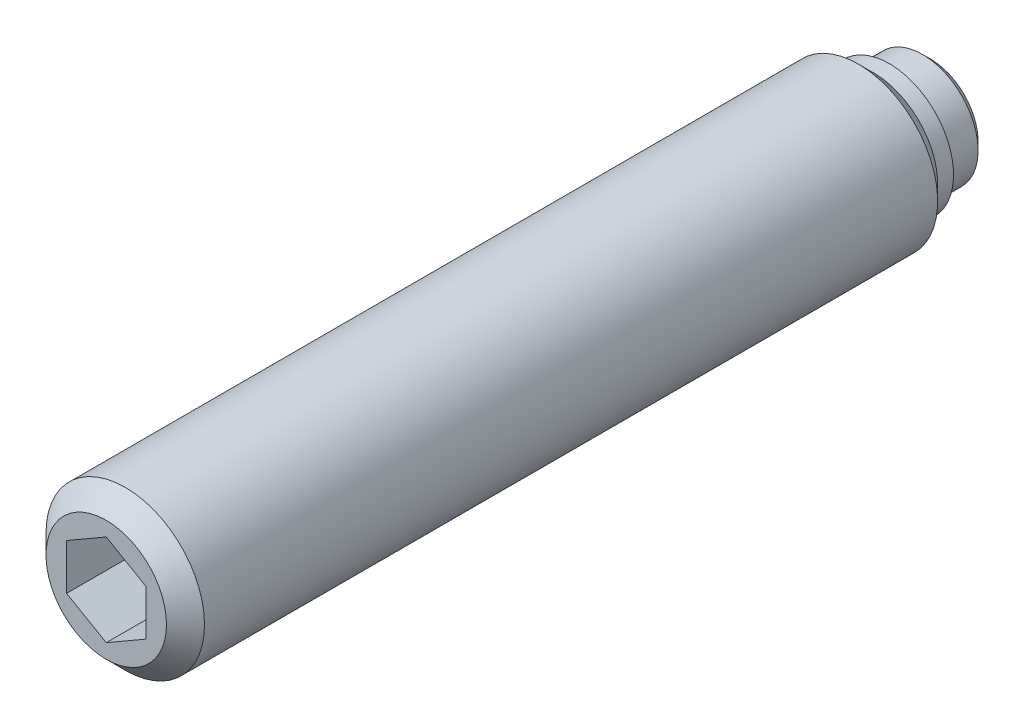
ISO-10303-21;
HEADER;
FILE_DESCRIPTION(('STEP AP214'),'2;1');
FILE_NAME('part.step','',(''),(''),'','','');
FILE_SCHEMA(('AUTOMOTIVE_DESIGN { 1 0 10303 214 1 1 1 1 }'));
ENDSEC;
DATA;
#1=APPLICATION_CONTEXT('core data for automotive mechanical design processes');
#2=APPLICATION_PROTOCOL_DEFINITION('international standard','automotive_design',2000,#1);
#3=PRODUCT_CONTEXT('',#1,'mechanical');
#4=PRODUCT('Part','Part','',(#3));
#5=PRODUCT_RELATED_PRODUCT_CATEGORY('part','',(#4));
#6=PRODUCT_DEFINITION_FORMATION('','',#4);
#7=PRODUCT_DEFINITION_CONTEXT('part definition',#1,'design');
#8=PRODUCT_DEFINITION('design','',#6,#7);
#9=PRODUCT_DEFINITION_SHAPE('','',#8);
#10=(LENGTH_UNIT() NAMED_UNIT(*) SI_UNIT(.MILLI.,.METRE.));
#11=(NAMED_UNIT(*) PLANE_ANGLE_UNIT() SI_UNIT($,.RADIAN.));
#12=(NAMED_UNIT(*) SI_UNIT($,.STERADIAN.) SOLID_ANGLE_UNIT());
#13=UNCERTAINTY_MEASURE_WITH_UNIT(LENGTH_MEASURE(1.E-05),#10,'distance_accuracy_value','');
#14=(GEOMETRIC_REPRESENTATION_CONTEXT(3) GLOBAL_UNCERTAINTY_ASSIGNED_CONTEXT((#13)) GLOBAL_UNIT_ASSIGNED_CONTEXT((#10,
#11,#12)) REPRESENTATION_CONTEXT('',''));
#15=CARTESIAN_POINT('',(0.,0.,0.));
#16=DIRECTION('',(0.,0.,1.));
#17=DIRECTION('',(1.,0.,0.));
#18=AXIS2_PLACEMENT_3D('',#15,#16,#17);
#19=CARTESIAN_POINT('',(0.,0.,2.6));
#20=DIRECTION('',(0.,0.,-1.));
#21=DIRECTION('',(-1.,0.,0.));
#22=AXIS2_PLACEMENT_3D('',#19,#20,#21);
#23=CYLINDRICAL_SURFACE('',#22,5.);
#24=CARTESIAN_POINT('',(0.,0.,4.55));
#25=DIRECTION('',(0.,0.,-1.));
#26=DIRECTION('',(-1.,0.,0.));
#27=AXIS2_PLACEMENT_3D('',#24,#25,#26);
#28=CIRCLE('',#27,5.);
#29=CARTESIAN_POINT('',(-5.,0.,4.55));
#30=VERTEX_POINT('',#29);
#31=EDGE_CURVE('E9',#30,#30,#28,.T.);
#32=ORIENTED_EDGE('',*,*,#31,.F.);
#33=EDGE_LOOP('',(#32));
#34=FACE_BOUND('',#33,.T.);
#35=CARTESIAN_POINT('',(0.,0.,50.8));
#36=DIRECTION('',(0.,0.,1.));
#37=DIRECTION('',(1.,0.,0.));
#38=AXIS2_PLACEMENT_3D('',#35,#36,#37);
#39=CIRCLE('',#38,5.);
#40=CARTESIAN_POINT('',(5.,0.,50.8));
#41=VERTEX_POINT('',#40);
#42=EDGE_CURVE('E123',#41,#41,#39,.T.);
#43=ORIENTED_EDGE('',*,*,#42,.F.);
#44=EDGE_LOOP('',(#43));
#45=FACE_BOUND('',#44,.T.);
#46=ADVANCED_FACE('F14',(#34,#45),#23,.T.);
#47=CARTESIAN_POINT('',(0.,0.,4.55));
#48=DIRECTION('',(0.,0.,1.));
#49=DIRECTION('',(1.,0.,0.));
#50=AXIS2_PLACEMENT_3D('',#47,#48,#49);
#51=CONICAL_SURFACE('',#50,5.,0.785398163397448);
#52=ORIENTED_EDGE('',*,*,#31,.T.);
#53=EDGE_LOOP('',(#52));
#54=FACE_BOUND('',#53,.T.);
#55=CARTESIAN_POINT('',(0.,0.,3.6));
#56=DIRECTION('',(0.,0.,-1.));
#57=DIRECTION('',(-1.,0.,0.));
#58=AXIS2_PLACEMENT_3D('',#55,#56,#57);
#59=CIRCLE('',#58,4.05);
#60=CARTESIAN_POINT('',(-4.05,0.,3.6));
#61=VERTEX_POINT('',#60);
#62=EDGE_CURVE('E21',#61,#61,#59,.T.);
#63=ORIENTED_EDGE('',*,*,#62,.F.);
#64=EDGE_LOOP('',(#63));
#65=FACE_BOUND('',#64,.T.);
#66=ADVANCED_FACE('F143',(#54,#65),#51,.T.);
#67=CARTESIAN_POINT('',(0.,0.,2.6));
#68=DIRECTION('',(0.,0.,-1.));
#69=DIRECTION('',(-1.,0.,0.));
#70=AXIS2_PLACEMENT_3D('',#67,#68,#69);
#71=CYLINDRICAL_SURFACE('',#70,4.05);
#72=ORIENTED_EDGE('',*,*,#62,.T.);
#73=EDGE_LOOP('',(#72));
#74=FACE_BOUND('',#73,.T.);
#75=CARTESIAN_POINT('',(0.,0.,2.6));
#76=DIRECTION('',(0.,0.,-1.));
#77=DIRECTION('',(-1.,0.,0.));
#78=AXIS2_PLACEMENT_3D('',#75,#76,#77);
#79=CIRCLE('',#78,4.05);
#80=CARTESIAN_POINT('',(-4.05,0.,2.6));
#81=VERTEX_POINT('',#80);
#82=EDGE_CURVE('E135',#81,#81,#79,.T.);
#83=ORIENTED_EDGE('',*,*,#82,.F.);
#84=EDGE_LOOP('',(#83));
#85=FACE_BOUND('',#84,.T.);
#86=ADVANCED_FACE('F140',(#74,#85),#71,.T.);
#87=CARTESIAN_POINT('',(0.,4.05,2.6));
#88=DIRECTION('',(0.,0.,1.));
#89=DIRECTION('',(1.,0.,0.));
#90=AXIS2_PLACEMENT_3D('',#87,#88,#89);
#91=PLANE('',#90);
#92=ORIENTED_EDGE('',*,*,#82,.T.);
#93=EDGE_LOOP('',(#92));
#94=FACE_BOUND('',#93,.T.);
#95=CARTESIAN_POINT('',(0.,0.,2.6));
#96=DIRECTION('',(0.,0.,-1.));
#97=DIRECTION('',(-1.,0.,0.));
#98=AXIS2_PLACEMENT_3D('',#95,#96,#97);
#99=CIRCLE('',#98,3.5);
#100=CARTESIAN_POINT('',(-3.5,0.,2.6));
#101=VERTEX_POINT('',#100);
#102=EDGE_CURVE('E132',#101,#101,#99,.T.);
#103=ORIENTED_EDGE('',*,*,#102,.F.);
#104=EDGE_LOOP('',(#103));
#105=FACE_BOUND('',#104,.T.);
#106=ADVANCED_FACE('F151',(#94,#105),#91,.F.);
#107=CARTESIAN_POINT('',(0.,0.,0.));
#108=DIRECTION('',(0.,0.,-1.));
#109=DIRECTION('',(-1.,0.,0.));
#110=AXIS2_PLACEMENT_3D('',#107,#108,#109);
#111=CYLINDRICAL_SURFACE('',#110,3.5);
#112=CARTESIAN_POINT('',(0.,0.,0.5));
#113=DIRECTION('',(0.,0.,-1.));
#114=DIRECTION('',(-1.,0.,0.));
#115=AXIS2_PLACEMENT_3D('',#112,#113,#114);
#116=CIRCLE('',#115,3.5);
#117=CARTESIAN_POINT('',(-3.5,0.,0.5));
#118=VERTEX_POINT('',#117);
#119=EDGE_CURVE('E129',#118,#118,#116,.T.);
#120=ORIENTED_EDGE('',*,*,#119,.F.);
#121=EDGE_LOOP('',(#120));
#122=FACE_BOUND('',#121,.T.);
#123=ORIENTED_EDGE('',*,*,#102,.T.);
#124=EDGE_LOOP('',(#123));
#125=FACE_BOUND('',#124,.T.);
#126=ADVANCED_FACE('F157',(#122,#125),#111,.T.);
#127=CARTESIAN_POINT('',(0.,0.,0.5));
#128=DIRECTION('',(0.,0.,1.));
#129=DIRECTION('',(1.,0.,0.));
#130=AXIS2_PLACEMENT_3D('',#127,#128,#129);
#131=CONICAL_SURFACE('',#130,3.5,0.785398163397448);
#132=CARTESIAN_POINT('',(0.,0.,0.));
#133=DIRECTION('',(0.,0.,-1.));
#134=DIRECTION('',(-1.,0.,0.));
#135=AXIS2_PLACEMENT_3D('',#132,#133,#134);
#136=CIRCLE('',#135,3.);
#137=CARTESIAN_POINT('',(-3.,0.,0.));
#138=VERTEX_POINT('',#137);
#139=EDGE_CURVE('E126',#138,#138,#136,.T.);
#140=ORIENTED_EDGE('',*,*,#139,.F.);
#141=EDGE_LOOP('',(#140));
#142=FACE_BOUND('',#141,.T.);
#143=ORIENTED_EDGE('',*,*,#119,.T.);
#144=EDGE_LOOP('',(#143));
#145=FACE_BOUND('',#144,.T.);
#146=ADVANCED_FACE('F161',(#142,#145),#131,.T.);
#147=CARTESIAN_POINT('',(0.,3.,0.));
#148=DIRECTION('',(0.,0.,1.));
#149=DIRECTION('',(1.,0.,0.));
#150=AXIS2_PLACEMENT_3D('',#147,#148,#149);
#151=PLANE('',#150);
#152=ORIENTED_EDGE('',*,*,#139,.T.);
#153=EDGE_LOOP('',(#152));
#154=FACE_BOUND('',#153,.T.);
#155=ADVANCED_FACE('F165',(#154),#151,.F.);
#156=CARTESIAN_POINT('',(0.,0.,52.));
#157=DIRECTION('',(0.,0.,-1.));
#158=DIRECTION('',(-1.,0.,0.));
#159=AXIS2_PLACEMENT_3D('',#156,#157,#158);
#160=CONICAL_SURFACE('',#159,3.8,0.785398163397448);
#161=ORIENTED_EDGE('',*,*,#42,.T.);
#162=EDGE_LOOP('',(#161));
#163=FACE_BOUND('',#162,.T.);
#164=CARTESIAN_POINT('',(0.,0.,52.));
#165=DIRECTION('',(0.,0.,1.));
#166=DIRECTION('',(1.,0.,0.));
#167=AXIS2_PLACEMENT_3D('',#164,#165,#166);
#168=CIRCLE('',#167,3.8);
#169=CARTESIAN_POINT('',(3.8,0.,52.));
#170=VERTEX_POINT('',#169);
#171=EDGE_CURVE('E115',#170,#170,#168,.T.);
#172=ORIENTED_EDGE('',*,*,#171,.F.);
#173=EDGE_LOOP('',(#172));
#174=FACE_BOUND('',#173,.T.);
#175=ADVANCED_FACE('F169',(#163,#174),#160,.T.);
#176=CARTESIAN_POINT('',(0.,-3.8,52.));
#177=DIRECTION('',(0.,0.,1.));
#178=DIRECTION('',(1.,0.,0.));
#179=AXIS2_PLACEMENT_3D('',#176,#177,#178);
#180=PLANE('',#179);
#181=DIRECTION('',(0.866025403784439,-0.5,0.));
#182=VECTOR('',#181,1.);
#183=CARTESIAN_POINT('',(-2.5,-1.44337567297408,52.));
#184=LINE('',#183,#182);
#185=CARTESIAN_POINT('',(-2.5,-1.44337567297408,52.));
#186=VERTEX_POINT('',#185);
#187=CARTESIAN_POINT('',(0.,-2.88675134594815,52.));
#188=VERTEX_POINT('',#187);
#189=EDGE_CURVE('E28',#186,#188,#184,.T.);
#190=ORIENTED_EDGE('',*,*,#189,.F.);
#191=DIRECTION('',(0.,-1.,0.));
#192=VECTOR('',#191,1.);
#193=CARTESIAN_POINT('',(-2.5,1.44337567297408,52.));
#194=LINE('',#193,#192);
#195=CARTESIAN_POINT('',(-2.5,1.44337567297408,52.));
#196=VERTEX_POINT('',#195);
#197=EDGE_CURVE('E111',#196,#186,#194,.T.);
#198=ORIENTED_EDGE('',*,*,#197,.F.);
#199=DIRECTION('',(-0.866025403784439,-0.5,0.));
#200=VECTOR('',#199,1.);
#201=CARTESIAN_POINT('',(0.,2.88675134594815,52.));
#202=LINE('',#201,#200);
#203=CARTESIAN_POINT('',(0.,2.88675134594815,52.));
#204=VERTEX_POINT('',#203);
#205=EDGE_CURVE('E109',#204,#196,#202,.T.);
#206=ORIENTED_EDGE('',*,*,#205,.F.);
#207=DIRECTION('',(-0.866025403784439,0.5,0.));
#208=VECTOR('',#207,1.);
#209=CARTESIAN_POINT('',(2.5,1.44337567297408,52.));
#210=LINE('',#209,#208);
#211=CARTESIAN_POINT('',(2.5,1.44337567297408,52.));
#212=VERTEX_POINT('',#211);
#213=EDGE_CURVE('E76',#212,#204,#210,.T.);
#214=ORIENTED_EDGE('',*,*,#213,.F.);
#215=DIRECTION('',(0.,1.,0.));
#216=VECTOR('',#215,1.);
#217=CARTESIAN_POINT('',(2.5,-1.44337567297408,52.));
#218=LINE('',#217,#216);
#219=CARTESIAN_POINT('',(2.5,-1.44337567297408,52.));
#220=VERTEX_POINT('',#219);
#221=EDGE_CURVE('E105',#220,#212,#218,.T.);
#222=ORIENTED_EDGE('',*,*,#221,.F.);
#223=DIRECTION('',(0.866025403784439,0.5,0.));
#224=VECTOR('',#223,1.);
#225=CARTESIAN_POINT('',(0.,-2.88675134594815,52.));
#226=LINE('',#225,#224);
#227=EDGE_CURVE('E102',#188,#220,#226,.T.);
#228=ORIENTED_EDGE('',*,*,#227,.F.);
#229=EDGE_LOOP('',(#190,#198,#206,#214,#222,#228));
#230=FACE_BOUND('',#229,.T.);
#231=ORIENTED_EDGE('',*,*,#171,.T.);
#232=EDGE_LOOP('',(#231));
#233=FACE_BOUND('',#232,.T.);
#234=ADVANCED_FACE('F173',(#230,#233),#180,.T.);
#235=CARTESIAN_POINT('',(-2.5,-1.44337567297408,46.));
#236=DIRECTION('',(-0.5,-0.866025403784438,0.));
#237=DIRECTION('',(0.866025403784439,-0.5,0.));
#238=AXIS2_PLACEMENT_3D('',#235,#236,#237);
#239=PLANE('',#238);
#240=ORIENTED_EDGE('',*,*,#189,.T.);
#241=DIRECTION('',(0.,0.,1.));
#242=VECTOR('',#241,1.);
#243=CARTESIAN_POINT('',(0.,-2.88675134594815,46.));
#244=LINE('',#243,#242);
#245=CARTESIAN_POINT('',(0.,-2.88675134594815,46.));
#246=VERTEX_POINT('',#245);
#247=EDGE_CURVE('E58',#246,#188,#244,.T.);
#248=ORIENTED_EDGE('',*,*,#247,.F.);
#249=DIRECTION('',(0.866025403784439,-0.5,0.));
#250=VECTOR('',#249,1.);
#251=CARTESIAN_POINT('',(-2.5,-1.44337567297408,46.));
#252=LINE('',#251,#250);
#253=CARTESIAN_POINT('',(-2.5,-1.44337567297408,46.));
#254=VERTEX_POINT('',#253);
#255=EDGE_CURVE('E113',#254,#246,#252,.T.);
#256=ORIENTED_EDGE('',*,*,#255,.F.);
#257=DIRECTION('',(0.,0.,1.));
#258=VECTOR('',#257,1.);
#259=CARTESIAN_POINT('',(-2.5,-1.44337567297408,46.));
#260=LINE('',#259,#258);
#261=EDGE_CURVE('E36',#254,#186,#260,.T.);
#262=ORIENTED_EDGE('',*,*,#261,.T.);
#263=EDGE_LOOP('',(#240,#248,#256,#262));
#264=FACE_BOUND('',#263,.T.);
#265=ADVANCED_FACE('F177',(#264),#239,.F.);
#266=CARTESIAN_POINT('',(-2.5,1.44337567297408,46.));
#267=DIRECTION('',(-1.,0.,0.));
#268=DIRECTION('',(0.,0.,1.));
#269=AXIS2_PLACEMENT_3D('',#266,#267,#268);
#270=PLANE('',#269);
#271=ORIENTED_EDGE('',*,*,#197,.T.);
#272=ORIENTED_EDGE('',*,*,#261,.F.);
#273=DIRECTION('',(0.,-1.,0.));
#274=VECTOR('',#273,1.);
#275=CARTESIAN_POINT('',(-2.5,1.44337567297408,46.));
#276=LINE('',#275,#274);
#277=CARTESIAN_POINT('',(-2.5,1.44337567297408,46.));
#278=VERTEX_POINT('',#277);
#279=EDGE_CURVE('E88',#278,#254,#276,.T.);
#280=ORIENTED_EDGE('',*,*,#279,.F.);
#281=DIRECTION('',(0.,0.,1.));
#282=VECTOR('',#281,1.);
#283=CARTESIAN_POINT('',(-2.5,1.44337567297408,46.));
#284=LINE('',#283,#282);
#285=EDGE_CURVE('E80',#278,#196,#284,.T.);
#286=ORIENTED_EDGE('',*,*,#285,.T.);
#287=EDGE_LOOP('',(#271,#272,#280,#286));
#288=FACE_BOUND('',#287,.T.);
#289=ADVANCED_FACE('F181',(#288),#270,.F.);
#290=CARTESIAN_POINT('',(0.,2.88675134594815,46.));
#291=DIRECTION('',(-0.5,0.866025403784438,0.));
#292=DIRECTION('',(-0.866025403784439,-0.5,0.));
#293=AXIS2_PLACEMENT_3D('',#290,#291,#292);
#294=PLANE('',#293);
#295=ORIENTED_EDGE('',*,*,#205,.T.);
#296=ORIENTED_EDGE('',*,*,#285,.F.);
#297=DIRECTION('',(-0.866025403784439,-0.5,0.));
#298=VECTOR('',#297,1.);
#299=CARTESIAN_POINT('',(0.,2.88675134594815,46.));
#300=LINE('',#299,#298);
#301=CARTESIAN_POINT('',(0.,2.88675134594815,46.));
#302=VERTEX_POINT('',#301);
#303=EDGE_CURVE('E84',#302,#278,#300,.T.);
#304=ORIENTED_EDGE('',*,*,#303,.F.);
#305=DIRECTION('',(0.,0.,1.));
#306=VECTOR('',#305,1.);
#307=CARTESIAN_POINT('',(0.,2.88675134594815,46.));
#308=LINE('',#307,#306);
#309=EDGE_CURVE('E69',#302,#204,#308,.T.);
#310=ORIENTED_EDGE('',*,*,#309,.T.);
#311=EDGE_LOOP('',(#295,#296,#304,#310));
#312=FACE_BOUND('',#311,.T.);
#313=ADVANCED_FACE('F85',(#312),#294,.F.);
#314=CARTESIAN_POINT('',(2.5,1.44337567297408,46.));
#315=DIRECTION('',(0.5,0.866025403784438,0.));
#316=DIRECTION('',(-0.866025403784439,0.5,0.));
#317=AXIS2_PLACEMENT_3D('',#314,#315,#316);
#318=PLANE('',#317);
#319=ORIENTED_EDGE('',*,*,#213,.T.);
#320=ORIENTED_EDGE('',*,*,#309,.F.);
#321=DIRECTION('',(-0.866025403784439,0.5,0.));
#322=VECTOR('',#321,1.);
#323=CARTESIAN_POINT('',(2.5,1.44337567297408,46.));
#324=LINE('',#323,#322);
#325=CARTESIAN_POINT('',(2.5,1.44337567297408,46.));
#326=VERTEX_POINT('',#325);
#327=EDGE_CURVE('E73',#326,#302,#324,.T.);
#328=ORIENTED_EDGE('',*,*,#327,.F.);
#329=DIRECTION('',(0.,0.,1.));
#330=VECTOR('',#329,1.);
#331=CARTESIAN_POINT('',(2.5,1.44337567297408,46.));
#332=LINE('',#331,#330);
#333=EDGE_CURVE('E81',#326,#212,#332,.T.);
#334=ORIENTED_EDGE('',*,*,#333,.T.);
#335=EDGE_LOOP('',(#319,#320,#328,#334));
#336=FACE_BOUND('',#335,.T.);
#337=ADVANCED_FACE('F71',(#336),#318,.F.);
#338=CARTESIAN_POINT('',(2.5,-1.44337567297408,46.));
#339=DIRECTION('',(1.,0.,0.));
#340=DIRECTION('',(0.,0.,-1.));
#341=AXIS2_PLACEMENT_3D('',#338,#339,#340);
#342=PLANE('',#341);
#343=ORIENTED_EDGE('',*,*,#221,.T.);
#344=ORIENTED_EDGE('',*,*,#333,.F.);
#345=DIRECTION('',(0.,1.,0.));
#346=VECTOR('',#345,1.);
#347=CARTESIAN_POINT('',(2.5,-1.44337567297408,46.));
#348=LINE('',#347,#346);
#349=CARTESIAN_POINT('',(2.5,-1.44337567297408,46.));
#350=VERTEX_POINT('',#349);
#351=EDGE_CURVE('E94',#350,#326,#348,.T.);
#352=ORIENTED_EDGE('',*,*,#351,.F.);
#353=DIRECTION('',(0.,0.,1.));
#354=VECTOR('',#353,1.);
#355=CARTESIAN_POINT('',(2.5,-1.44337567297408,46.));
#356=LINE('',#355,#354);
#357=EDGE_CURVE('E118',#350,#220,#356,.T.);
#358=ORIENTED_EDGE('',*,*,#357,.T.);
#359=EDGE_LOOP('',(#343,#344,#352,#358));
#360=FACE_BOUND('',#359,.T.);
#361=ADVANCED_FACE('F185',(#360),#342,.F.);
#362=CARTESIAN_POINT('',(0.,-2.88675134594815,46.));
#363=DIRECTION('',(0.5,-0.866025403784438,0.));
#364=DIRECTION('',(0.866025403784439,0.5,0.));
#365=AXIS2_PLACEMENT_3D('',#362,#363,#364);
#366=PLANE('',#365);
#367=ORIENTED_EDGE('',*,*,#227,.T.);
#368=ORIENTED_EDGE('',*,*,#357,.F.);
#369=DIRECTION('',(0.866025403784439,0.5,0.));
#370=VECTOR('',#369,1.);
#371=CARTESIAN_POINT('',(0.,-2.88675134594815,46.));
#372=LINE('',#371,#370);
#373=EDGE_CURVE('E96',#246,#350,#372,.T.);
#374=ORIENTED_EDGE('',*,*,#373,.F.);
#375=ORIENTED_EDGE('',*,*,#247,.T.);
#376=EDGE_LOOP('',(#367,#368,#374,#375));
#377=FACE_BOUND('',#376,.T.);
#378=ADVANCED_FACE('F182',(#377),#366,.F.);
#379=CARTESIAN_POINT('',(0.,0.,46.));
#380=DIRECTION('',(0.,0.,1.));
#381=DIRECTION('',(1.,0.,0.));
#382=AXIS2_PLACEMENT_3D('',#379,#380,#381);
#383=PLANE('',#382);
#384=ORIENTED_EDGE('',*,*,#255,.T.);
#385=ORIENTED_EDGE('',*,*,#373,.T.);
#386=ORIENTED_EDGE('',*,*,#351,.T.);
#387=ORIENTED_EDGE('',*,*,#327,.T.);
#388=ORIENTED_EDGE('',*,*,#303,.T.);
#389=ORIENTED_EDGE('',*,*,#279,.T.);
#390=EDGE_LOOP('',(#384,#385,#386,#387,#388,#389));
#391=FACE_BOUND('',#390,.T.);
#392=ADVANCED_FACE('F91',(#391),#383,.T.);
#393=CLOSED_SHELL('',(#46,#66,#86,#106,#126,#146,#155,#175,#234,#265,#289,#313,#337,#361,#378,#392));
#394=MANIFOLD_SOLID_BREP('B1',#393);
#395=ADVANCED_BREP_SHAPE_REPRESENTATION('',(#18,#394),#14);
#396=SHAPE_DEFINITION_REPRESENTATION(#9,#395);
ENDSEC;
END-ISO-10303-21;
